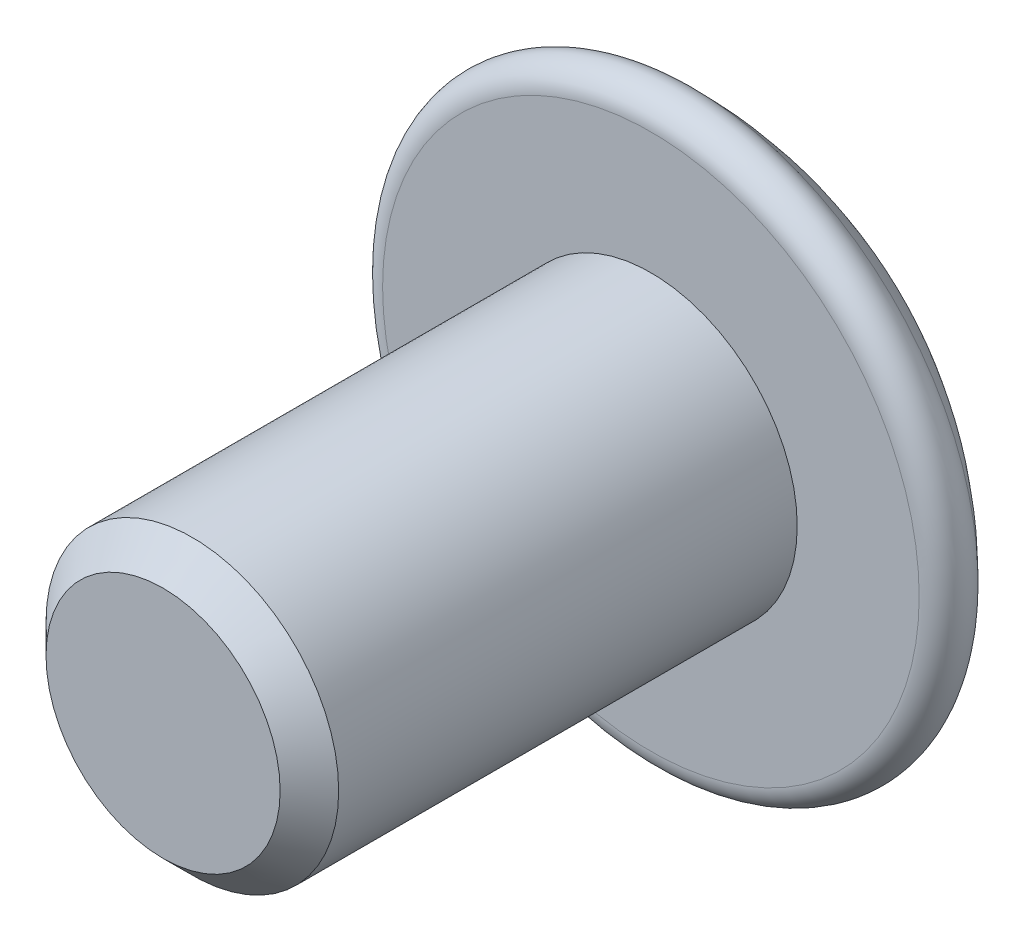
ISO-10303-21;
HEADER;
FILE_DESCRIPTION(('STEP AP214'),'2;1');
FILE_NAME('part.step','',(''),(''),'','','');
FILE_SCHEMA(('AUTOMOTIVE_DESIGN { 1 0 10303 214 1 1 1 1 }'));
ENDSEC;
DATA;
#1=APPLICATION_CONTEXT('core data for automotive mechanical design processes');
#2=APPLICATION_PROTOCOL_DEFINITION('international standard','automotive_design',2000,#1);
#3=PRODUCT_CONTEXT('',#1,'mechanical');
#4=PRODUCT('Part','Part','',(#3));
#5=PRODUCT_RELATED_PRODUCT_CATEGORY('part','',(#4));
#6=PRODUCT_DEFINITION_FORMATION('','',#4);
#7=PRODUCT_DEFINITION_CONTEXT('part definition',#1,'design');
#8=PRODUCT_DEFINITION('design','',#6,#7);
#9=PRODUCT_DEFINITION_SHAPE('','',#8);
#10=(LENGTH_UNIT() NAMED_UNIT(*) SI_UNIT(.MILLI.,.METRE.));
#11=(NAMED_UNIT(*) PLANE_ANGLE_UNIT() SI_UNIT($,.RADIAN.));
#12=(NAMED_UNIT(*) SI_UNIT($,.STERADIAN.) SOLID_ANGLE_UNIT());
#13=UNCERTAINTY_MEASURE_WITH_UNIT(LENGTH_MEASURE(1.E-05),#10,'distance_accuracy_value','');
#14=(GEOMETRIC_REPRESENTATION_CONTEXT(3) GLOBAL_UNCERTAINTY_ASSIGNED_CONTEXT((#13)) GLOBAL_UNIT_ASSIGNED_CONTEXT((#10,
#11,#12)) REPRESENTATION_CONTEXT('',''));
#15=CARTESIAN_POINT('',(0.,0.,0.));
#16=DIRECTION('',(0.,0.,1.));
#17=DIRECTION('',(1.,0.,0.));
#18=AXIS2_PLACEMENT_3D('',#15,#16,#17);
#19=CARTESIAN_POINT('',(0.,0.,4.92608695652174));
#20=DIRECTION('',(0.,0.,-1.));
#21=DIRECTION('',(1.,0.,0.));
#22=AXIS2_PLACEMENT_3D('',#19,#20,#21);
#23=SPHERICAL_SURFACE('',#22,8.22608695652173);
#24=CARTESIAN_POINT('',(0.,0.,-0.851153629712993));
#25=DIRECTION('',(0.,0.,-1.));
#26=DIRECTION('',(-1.,0.,0.));
#27=AXIS2_PLACEMENT_3D('',#24,#25,#26);
#28=CIRCLE('',#27,5.85593697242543);
#29=CARTESIAN_POINT('',(-5.85593697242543,0.,-0.851153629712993));
#30=VERTEX_POINT('',#29);
#31=EDGE_CURVE('E89',#30,#30,#28,.T.);
#32=ORIENTED_EDGE('',*,*,#31,.T.);
#33=EDGE_LOOP('',(#32));
#34=FACE_BOUND('',#33,.T.);
#35=CARTESIAN_POINT('',(-1.,1.73205080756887,4.92608695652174));
#36=DIRECTION('',(0.5,-0.866025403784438,0.));
#37=DIRECTION('',(0.866025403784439,0.5,0.));
#38=AXIS2_PLACEMENT_3D('',#35,#36,#37);
#39=CIRCLE('',#38,7.97925476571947);
#40=CARTESIAN_POINT('',(-2.,1.15470053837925,-2.96917575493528));
#41=VERTEX_POINT('',#40);
#42=CARTESIAN_POINT('',(0.,2.30940107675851,-2.96917575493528));
#43=VERTEX_POINT('',#42);
#44=EDGE_CURVE('E110',#41,#43,#39,.T.);
#45=ORIENTED_EDGE('',*,*,#44,.F.);
#46=CARTESIAN_POINT('',(-2.,0.,4.92608695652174));
#47=DIRECTION('',(1.,0.,0.));
#48=DIRECTION('',(0.,0.,-1.));
#49=AXIS2_PLACEMENT_3D('',#46,#47,#48);
#50=CIRCLE('',#49,7.97925476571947);
#51=CARTESIAN_POINT('',(-2.,-1.15470053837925,-2.96917575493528));
#52=VERTEX_POINT('',#51);
#53=EDGE_CURVE('E41',#52,#41,#50,.T.);
#54=ORIENTED_EDGE('',*,*,#53,.F.);
#55=CARTESIAN_POINT('',(-1.,-1.73205080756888,4.92608695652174));
#56=DIRECTION('',(0.5,0.866025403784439,0.));
#57=DIRECTION('',(-0.866025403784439,0.5,0.));
#58=AXIS2_PLACEMENT_3D('',#55,#56,#57);
#59=CIRCLE('',#58,7.97925476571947);
#60=CARTESIAN_POINT('',(0.,-2.30940107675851,-2.96917575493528));
#61=VERTEX_POINT('',#60);
#62=EDGE_CURVE('E107',#61,#52,#59,.T.);
#63=ORIENTED_EDGE('',*,*,#62,.F.);
#64=CARTESIAN_POINT('',(1.,-1.73205080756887,4.92608695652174));
#65=DIRECTION('',(-0.5,0.866025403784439,0.));
#66=DIRECTION('',(-0.866025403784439,-0.5,0.));
#67=AXIS2_PLACEMENT_3D('',#64,#65,#66);
#68=CIRCLE('',#67,7.97925476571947);
#69=CARTESIAN_POINT('',(2.,-1.15470053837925,-2.96917575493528));
#70=VERTEX_POINT('',#69);
#71=EDGE_CURVE('E105',#70,#61,#68,.T.);
#72=ORIENTED_EDGE('',*,*,#71,.F.);
#73=CARTESIAN_POINT('',(2.,0.,4.92608695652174));
#74=DIRECTION('',(-1.,0.,0.));
#75=DIRECTION('',(0.,0.,1.));
#76=AXIS2_PLACEMENT_3D('',#73,#74,#75);
#77=CIRCLE('',#76,7.97925476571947);
#78=CARTESIAN_POINT('',(2.,1.15470053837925,-2.96917575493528));
#79=VERTEX_POINT('',#78);
#80=EDGE_CURVE('E103',#79,#70,#77,.T.);
#81=ORIENTED_EDGE('',*,*,#80,.F.);
#82=CARTESIAN_POINT('',(1.,1.73205080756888,4.92608695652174));
#83=DIRECTION('',(-0.5,-0.866025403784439,0.));
#84=DIRECTION('',(0.866025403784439,-0.5,0.));
#85=AXIS2_PLACEMENT_3D('',#82,#83,#84);
#86=CIRCLE('',#85,7.97925476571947);
#87=EDGE_CURVE('E101',#43,#79,#86,.T.);
#88=ORIENTED_EDGE('',*,*,#87,.F.);
#89=EDGE_LOOP('',(#45,#54,#63,#72,#81,#88));
#90=FACE_BOUND('',#89,.T.);
#91=ADVANCED_FACE('F18',(#34,#90),#23,.T.);
#92=CARTESIAN_POINT('',(0.,0.,0.));
#93=DIRECTION('',(0.,0.,-1.));
#94=DIRECTION('',(-1.,0.,0.));
#95=AXIS2_PLACEMENT_3D('',#92,#93,#94);
#96=PLANE('',#95);
#97=CARTESIAN_POINT('',(0.,0.,0.));
#98=DIRECTION('',(0.,0.,1.));
#99=DIRECTION('',(1.,0.,0.));
#100=AXIS2_PLACEMENT_3D('',#97,#98,#99);
#101=CIRCLE('',#100,3.);
#102=CARTESIAN_POINT('',(3.,0.,0.));
#103=VERTEX_POINT('',#102);
#104=EDGE_CURVE('E86',#103,#103,#101,.T.);
#105=ORIENTED_EDGE('',*,*,#104,.F.);
#106=EDGE_LOOP('',(#105));
#107=FACE_BOUND('',#106,.T.);
#108=CARTESIAN_POINT('',(0.,0.,0.));
#109=DIRECTION('',(0.,0.,-1.));
#110=DIRECTION('',(-1.,0.,0.));
#111=AXIS2_PLACEMENT_3D('',#108,#109,#110);
#112=CIRCLE('',#111,5.5);
#113=CARTESIAN_POINT('',(-5.5,0.,0.));
#114=VERTEX_POINT('',#113);
#115=EDGE_CURVE('E93',#114,#114,#112,.T.);
#116=ORIENTED_EDGE('',*,*,#115,.F.);
#117=EDGE_LOOP('',(#116));
#118=FACE_BOUND('',#117,.T.);
#119=ADVANCED_FACE('F128',(#107,#118),#96,.F.);
#120=CARTESIAN_POINT('',(0.,0.,-0.5));
#121=DIRECTION('',(0.,0.,-1.));
#122=DIRECTION('',(-1.,0.,0.));
#123=AXIS2_PLACEMENT_3D('',#120,#121,#122);
#124=TOROIDAL_SURFACE('',#123,5.5,0.499999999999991);
#125=ORIENTED_EDGE('',*,*,#31,.F.);
#126=EDGE_LOOP('',(#125));
#127=FACE_BOUND('',#126,.T.);
#128=ORIENTED_EDGE('',*,*,#115,.T.);
#129=EDGE_LOOP('',(#128));
#130=FACE_BOUND('',#129,.T.);
#131=ADVANCED_FACE('F135',(#127,#130),#124,.T.);
#132=CARTESIAN_POINT('',(0.,2.30940107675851,-1.8));
#133=DIRECTION('',(0.5,-0.866025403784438,0.));
#134=DIRECTION('',(0.866025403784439,0.5,0.));
#135=AXIS2_PLACEMENT_3D('',#132,#133,#134);
#136=PLANE('',#135);
#137=ORIENTED_EDGE('',*,*,#44,.T.);
#138=DIRECTION('',(0.,0.,-1.));
#139=VECTOR('',#138,1.);
#140=CARTESIAN_POINT('',(0.,2.30940107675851,-1.8));
#141=LINE('',#140,#139);
#142=CARTESIAN_POINT('',(0.,2.30940107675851,-1.8));
#143=VERTEX_POINT('',#142);
#144=EDGE_CURVE('E33',#143,#43,#141,.T.);
#145=ORIENTED_EDGE('',*,*,#144,.F.);
#146=DIRECTION('',(-0.866025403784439,-0.5,0.));
#147=VECTOR('',#146,1.);
#148=CARTESIAN_POINT('',(0.,2.30940107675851,-1.8));
#149=LINE('',#148,#147);
#150=CARTESIAN_POINT('',(-2.,1.15470053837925,-1.8));
#151=VERTEX_POINT('',#150);
#152=EDGE_CURVE('E77',#143,#151,#149,.T.);
#153=ORIENTED_EDGE('',*,*,#152,.T.);
#154=DIRECTION('',(0.,0.,-1.));
#155=VECTOR('',#154,1.);
#156=CARTESIAN_POINT('',(-2.,1.15470053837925,-1.8));
#157=LINE('',#156,#155);
#158=EDGE_CURVE('E84',#151,#41,#157,.T.);
#159=ORIENTED_EDGE('',*,*,#158,.T.);
#160=EDGE_LOOP('',(#137,#145,#153,#159));
#161=FACE_BOUND('',#160,.T.);
#162=ADVANCED_FACE('F83',(#161),#136,.T.);
#163=CARTESIAN_POINT('',(-2.,1.15470053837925,-1.8));
#164=DIRECTION('',(1.,0.,0.));
#165=DIRECTION('',(0.,0.,-1.));
#166=AXIS2_PLACEMENT_3D('',#163,#164,#165);
#167=PLANE('',#166);
#168=ORIENTED_EDGE('',*,*,#53,.T.);
#169=ORIENTED_EDGE('',*,*,#158,.F.);
#170=DIRECTION('',(0.,-1.,0.));
#171=VECTOR('',#170,1.);
#172=CARTESIAN_POINT('',(-2.,1.15470053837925,-1.8));
#173=LINE('',#172,#171);
#174=CARTESIAN_POINT('',(-2.,-1.15470053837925,-1.8));
#175=VERTEX_POINT('',#174);
#176=EDGE_CURVE('E73',#151,#175,#173,.T.);
#177=ORIENTED_EDGE('',*,*,#176,.T.);
#178=DIRECTION('',(0.,0.,-1.));
#179=VECTOR('',#178,1.);
#180=CARTESIAN_POINT('',(-2.,-1.15470053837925,-1.8));
#181=LINE('',#180,#179);
#182=EDGE_CURVE('E90',#175,#52,#181,.T.);
#183=ORIENTED_EDGE('',*,*,#182,.T.);
#184=EDGE_LOOP('',(#168,#169,#177,#183));
#185=FACE_BOUND('',#184,.T.);
#186=ADVANCED_FACE('F88',(#185),#167,.T.);
#187=CARTESIAN_POINT('',(-2.,-1.15470053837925,-1.8));
#188=DIRECTION('',(0.5,0.866025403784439,0.));
#189=DIRECTION('',(-0.866025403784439,0.5,0.));
#190=AXIS2_PLACEMENT_3D('',#187,#188,#189);
#191=PLANE('',#190);
#192=ORIENTED_EDGE('',*,*,#62,.T.);
#193=ORIENTED_EDGE('',*,*,#182,.F.);
#194=DIRECTION('',(0.866025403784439,-0.5,0.));
#195=VECTOR('',#194,1.);
#196=CARTESIAN_POINT('',(-2.,-1.15470053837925,-1.8));
#197=LINE('',#196,#195);
#198=CARTESIAN_POINT('',(0.,-2.30940107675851,-1.8));
#199=VERTEX_POINT('',#198);
#200=EDGE_CURVE('E79',#175,#199,#197,.T.);
#201=ORIENTED_EDGE('',*,*,#200,.T.);
#202=DIRECTION('',(0.,0.,-1.));
#203=VECTOR('',#202,1.);
#204=CARTESIAN_POINT('',(0.,-2.30940107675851,-1.8));
#205=LINE('',#204,#203);
#206=EDGE_CURVE('E95',#199,#61,#205,.T.);
#207=ORIENTED_EDGE('',*,*,#206,.T.);
#208=EDGE_LOOP('',(#192,#193,#201,#207));
#209=FACE_BOUND('',#208,.T.);
#210=ADVANCED_FACE('F155',(#209),#191,.T.);
#211=CARTESIAN_POINT('',(0.,-2.30940107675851,-1.8));
#212=DIRECTION('',(-0.5,0.866025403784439,0.));
#213=DIRECTION('',(-0.866025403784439,-0.5,0.));
#214=AXIS2_PLACEMENT_3D('',#211,#212,#213);
#215=PLANE('',#214);
#216=ORIENTED_EDGE('',*,*,#71,.T.);
#217=ORIENTED_EDGE('',*,*,#206,.F.);
#218=DIRECTION('',(0.866025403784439,0.5,0.));
#219=VECTOR('',#218,1.);
#220=CARTESIAN_POINT('',(0.,-2.30940107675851,-1.8));
#221=LINE('',#220,#219);
#222=CARTESIAN_POINT('',(2.,-1.15470053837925,-1.8));
#223=VERTEX_POINT('',#222);
#224=EDGE_CURVE('E594',#199,#223,#221,.T.);
#225=ORIENTED_EDGE('',*,*,#224,.T.);
#226=DIRECTION('',(0.,0.,-1.));
#227=VECTOR('',#226,1.);
#228=CARTESIAN_POINT('',(2.,-1.15470053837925,-1.8));
#229=LINE('',#228,#227);
#230=EDGE_CURVE('E582',#223,#70,#229,.T.);
#231=ORIENTED_EDGE('',*,*,#230,.T.);
#232=EDGE_LOOP('',(#216,#217,#225,#231));
#233=FACE_BOUND('',#232,.T.);
#234=ADVANCED_FACE('F160',(#233),#215,.T.);
#235=CARTESIAN_POINT('',(2.,-1.15470053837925,-1.8));
#236=DIRECTION('',(-1.,0.,0.));
#237=DIRECTION('',(0.,0.,1.));
#238=AXIS2_PLACEMENT_3D('',#235,#236,#237);
#239=PLANE('',#238);
#240=ORIENTED_EDGE('',*,*,#80,.T.);
#241=ORIENTED_EDGE('',*,*,#230,.F.);
#242=DIRECTION('',(0.,1.,0.));
#243=VECTOR('',#242,1.);
#244=CARTESIAN_POINT('',(2.,-1.15470053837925,-1.8));
#245=LINE('',#244,#243);
#246=CARTESIAN_POINT('',(2.,1.15470053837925,-1.8));
#247=VERTEX_POINT('',#246);
#248=EDGE_CURVE('E581',#223,#247,#245,.T.);
#249=ORIENTED_EDGE('',*,*,#248,.T.);
#250=DIRECTION('',(0.,0.,-1.));
#251=VECTOR('',#250,1.);
#252=CARTESIAN_POINT('',(2.,1.15470053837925,-1.8));
#253=LINE('',#252,#251);
#254=EDGE_CURVE('E576',#247,#79,#253,.T.);
#255=ORIENTED_EDGE('',*,*,#254,.T.);
#256=EDGE_LOOP('',(#240,#241,#249,#255));
#257=FACE_BOUND('',#256,.T.);
#258=ADVANCED_FACE('F166',(#257),#239,.T.);
#259=CARTESIAN_POINT('',(2.,1.15470053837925,-1.8));
#260=DIRECTION('',(-0.5,-0.866025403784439,0.));
#261=DIRECTION('',(0.866025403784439,-0.5,0.));
#262=AXIS2_PLACEMENT_3D('',#259,#260,#261);
#263=PLANE('',#262);
#264=ORIENTED_EDGE('',*,*,#87,.T.);
#265=ORIENTED_EDGE('',*,*,#254,.F.);
#266=DIRECTION('',(-0.866025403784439,0.5,0.));
#267=VECTOR('',#266,1.);
#268=CARTESIAN_POINT('',(2.,1.15470053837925,-1.8));
#269=LINE('',#268,#267);
#270=EDGE_CURVE('E591',#247,#143,#269,.T.);
#271=ORIENTED_EDGE('',*,*,#270,.T.);
#272=ORIENTED_EDGE('',*,*,#144,.T.);
#273=EDGE_LOOP('',(#264,#265,#271,#272));
#274=FACE_BOUND('',#273,.T.);
#275=ADVANCED_FACE('F170',(#274),#263,.T.);
#276=CARTESIAN_POINT('',(-4.,0.,-1.8));
#277=DIRECTION('',(0.,0.,1.));
#278=DIRECTION('',(1.,0.,0.));
#279=AXIS2_PLACEMENT_3D('',#276,#277,#278);
#280=PLANE('',#279);
#281=ORIENTED_EDGE('',*,*,#152,.F.);
#282=ORIENTED_EDGE('',*,*,#270,.F.);
#283=ORIENTED_EDGE('',*,*,#248,.F.);
#284=ORIENTED_EDGE('',*,*,#224,.F.);
#285=ORIENTED_EDGE('',*,*,#200,.F.);
#286=ORIENTED_EDGE('',*,*,#176,.F.);
#287=EDGE_LOOP('',(#281,#282,#283,#284,#285,#286));
#288=FACE_BOUND('',#287,.T.);
#289=ADVANCED_FACE('F75',(#288),#280,.F.);
#290=CARTESIAN_POINT('',(0.,0.,10.));
#291=DIRECTION('',(0.,0.,1.));
#292=DIRECTION('',(1.,0.,0.));
#293=AXIS2_PLACEMENT_3D('',#290,#291,#292);
#294=PLANE('',#293);
#295=CARTESIAN_POINT('',(0.,0.,10.));
#296=DIRECTION('',(0.,0.,1.));
#297=DIRECTION('',(1.,0.,0.));
#298=AXIS2_PLACEMENT_3D('',#295,#296,#297);
#299=CIRCLE('',#298,2.4);
#300=CARTESIAN_POINT('',(2.4,0.,10.));
#301=VERTEX_POINT('',#300);
#302=EDGE_CURVE('E26',#301,#301,#299,.T.);
#303=ORIENTED_EDGE('',*,*,#302,.T.);
#304=EDGE_LOOP('',(#303));
#305=FACE_BOUND('',#304,.T.);
#306=ADVANCED_FACE('F114',(#305),#294,.T.);
#307=CARTESIAN_POINT('',(0.,0.,0.));
#308=DIRECTION('',(0.,0.,1.));
#309=DIRECTION('',(1.,0.,0.));
#310=AXIS2_PLACEMENT_3D('',#307,#308,#309);
#311=CYLINDRICAL_SURFACE('',#310,3.);
#312=CARTESIAN_POINT('',(0.,0.,9.4));
#313=DIRECTION('',(0.,0.,1.));
#314=DIRECTION('',(1.,0.,0.));
#315=AXIS2_PLACEMENT_3D('',#312,#313,#314);
#316=CIRCLE('',#315,3.);
#317=CARTESIAN_POINT('',(3.,0.,9.4));
#318=VERTEX_POINT('',#317);
#319=EDGE_CURVE('E11',#318,#318,#316,.F.);
#320=ORIENTED_EDGE('',*,*,#319,.T.);
#321=EDGE_LOOP('',(#320));
#322=FACE_BOUND('',#321,.T.);
#323=ORIENTED_EDGE('',*,*,#104,.T.);
#324=EDGE_LOOP('',(#323));
#325=FACE_BOUND('',#324,.T.);
#326=ADVANCED_FACE('F117',(#322,#325),#311,.T.);
#327=CARTESIAN_POINT('',(0.,0.,10.));
#328=DIRECTION('',(0.,0.,-1.));
#329=DIRECTION('',(-1.,0.,0.));
#330=AXIS2_PLACEMENT_3D('',#327,#328,#329);
#331=CONICAL_SURFACE('',#330,2.4,0.785398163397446);
#332=ORIENTED_EDGE('',*,*,#319,.F.);
#333=EDGE_LOOP('',(#332));
#334=FACE_BOUND('',#333,.T.);
#335=ORIENTED_EDGE('',*,*,#302,.F.);
#336=EDGE_LOOP('',(#335));
#337=FACE_BOUND('',#336,.T.);
#338=ADVANCED_FACE('F20',(#334,#337),#331,.T.);
#339=CLOSED_SHELL('',(#91,#119,#131,#162,#186,#210,#234,#258,#275,#289,#306,#326,#338));
#340=MANIFOLD_SOLID_BREP('B1',#339);
#341=ADVANCED_BREP_SHAPE_REPRESENTATION('',(#18,#340),#14);
#342=SHAPE_DEFINITION_REPRESENTATION(#9,#341);
ENDSEC;
END-ISO-10303-21;
